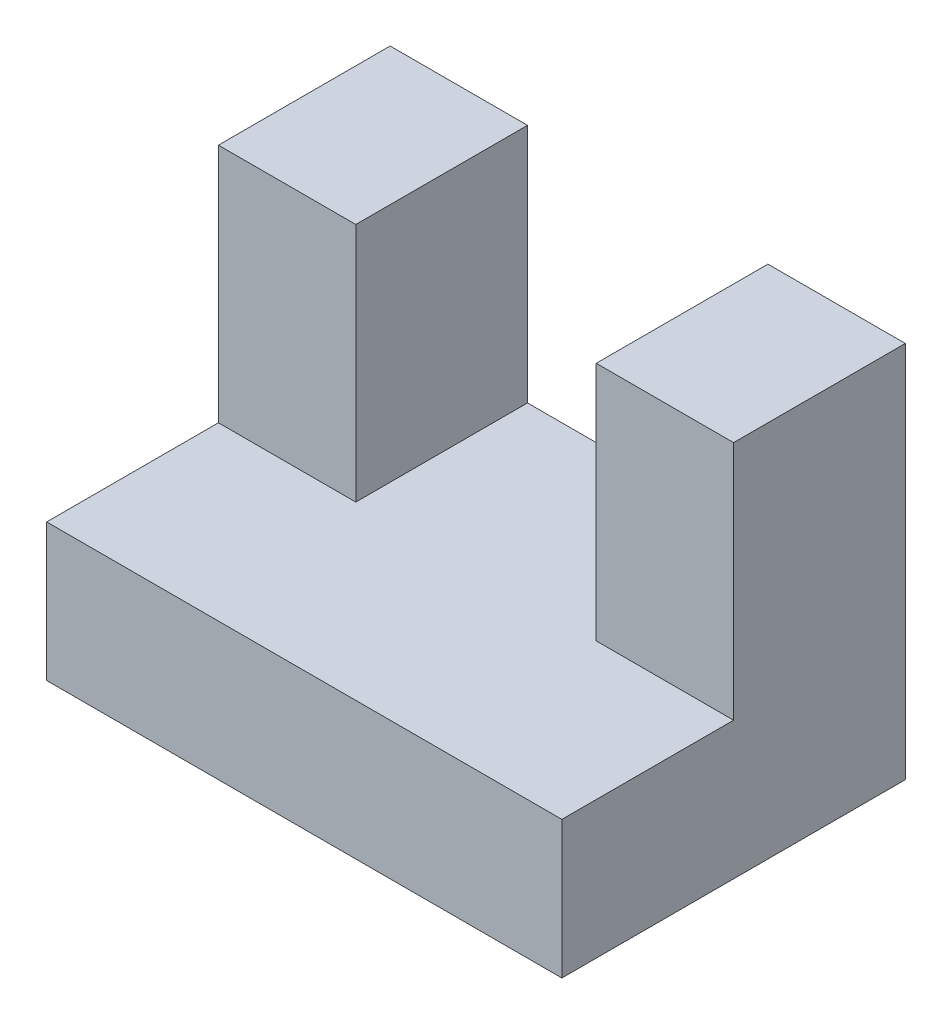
ISO-10303-21;
HEADER;
FILE_DESCRIPTION(('STEP AP214'),'2;1');
FILE_NAME('part.step','',(''),(''),'','','');
FILE_SCHEMA(('AUTOMOTIVE_DESIGN { 1 0 10303 214 1 1 1 1 }'));
ENDSEC;
DATA;
#1=APPLICATION_CONTEXT('core data for automotive mechanical design processes');
#2=APPLICATION_PROTOCOL_DEFINITION('international standard','automotive_design',2000,#1);
#3=PRODUCT_CONTEXT('',#1,'mechanical');
#4=PRODUCT('Part','Part','',(#3));
#5=PRODUCT_RELATED_PRODUCT_CATEGORY('part','',(#4));
#6=PRODUCT_DEFINITION_FORMATION('','',#4);
#7=PRODUCT_DEFINITION_CONTEXT('part definition',#1,'design');
#8=PRODUCT_DEFINITION('design','',#6,#7);
#9=PRODUCT_DEFINITION_SHAPE('','',#8);
#10=(LENGTH_UNIT() NAMED_UNIT(*) SI_UNIT(.MILLI.,.METRE.));
#11=(NAMED_UNIT(*) PLANE_ANGLE_UNIT() SI_UNIT($,.RADIAN.));
#12=(NAMED_UNIT(*) SI_UNIT($,.STERADIAN.) SOLID_ANGLE_UNIT());
#13=UNCERTAINTY_MEASURE_WITH_UNIT(LENGTH_MEASURE(1.E-05),#10,'distance_accuracy_value','');
#14=(GEOMETRIC_REPRESENTATION_CONTEXT(3) GLOBAL_UNCERTAINTY_ASSIGNED_CONTEXT((#13)) GLOBAL_UNIT_ASSIGNED_CONTEXT((#10,
#11,#12)) REPRESENTATION_CONTEXT('',''));
#15=CARTESIAN_POINT('',(0.,0.,0.));
#16=DIRECTION('',(0.,0.,1.));
#17=DIRECTION('',(1.,0.,0.));
#18=AXIS2_PLACEMENT_3D('',#15,#16,#17);
#19=CARTESIAN_POINT('',(0.,8.,-20.));
#20=DIRECTION('',(0.,-1.,0.));
#21=DIRECTION('',(0.,0.,-1.));
#22=AXIS2_PLACEMENT_3D('',#19,#20,#21);
#23=PLANE('',#22);
#24=DIRECTION('',(0.,0.,1.));
#25=VECTOR('',#24,1.);
#26=CARTESIAN_POINT('',(22.,8.,-20.));
#27=LINE('',#26,#25);
#28=CARTESIAN_POINT('',(22.,8.,-20.));
#29=VERTEX_POINT('',#28);
#30=CARTESIAN_POINT('',(22.,8.,-10.));
#31=VERTEX_POINT('',#30);
#32=EDGE_CURVE('E137',#29,#31,#27,.T.);
#33=ORIENTED_EDGE('',*,*,#32,.F.);
#34=DIRECTION('',(-1.,0.,0.));
#35=VECTOR('',#34,1.);
#36=CARTESIAN_POINT('',(0.,8.,-20.));
#37=LINE('',#36,#35);
#38=CARTESIAN_POINT('',(8.,8.,-20.));
#39=VERTEX_POINT('',#38);
#40=EDGE_CURVE('E35',#29,#39,#37,.T.);
#41=ORIENTED_EDGE('',*,*,#40,.T.);
#42=DIRECTION('',(0.,0.,-1.));
#43=VECTOR('',#42,1.);
#44=CARTESIAN_POINT('',(8.,8.,-20.));
#45=LINE('',#44,#43);
#46=CARTESIAN_POINT('',(8.,8.,-10.));
#47=VERTEX_POINT('',#46);
#48=EDGE_CURVE('E154',#47,#39,#45,.T.);
#49=ORIENTED_EDGE('',*,*,#48,.F.);
#50=DIRECTION('',(1.,0.,0.));
#51=VECTOR('',#50,1.);
#52=CARTESIAN_POINT('',(0.,8.,-10.));
#53=LINE('',#52,#51);
#54=CARTESIAN_POINT('',(0.,8.,-10.));
#55=VERTEX_POINT('',#54);
#56=EDGE_CURVE('E149',#55,#47,#53,.T.);
#57=ORIENTED_EDGE('',*,*,#56,.F.);
#58=DIRECTION('',(0.,0.,1.));
#59=VECTOR('',#58,1.);
#60=CARTESIAN_POINT('',(0.,8.,0.));
#61=LINE('',#60,#59);
#62=CARTESIAN_POINT('',(0.,8.,0.));
#63=VERTEX_POINT('',#62);
#64=EDGE_CURVE('E193',#55,#63,#61,.T.);
#65=ORIENTED_EDGE('',*,*,#64,.T.);
#66=DIRECTION('',(1.,0.,0.));
#67=VECTOR('',#66,1.);
#68=CARTESIAN_POINT('',(0.,8.,0.));
#69=LINE('',#68,#67);
#70=CARTESIAN_POINT('',(30.,8.,0.));
#71=VERTEX_POINT('',#70);
#72=EDGE_CURVE('E194',#63,#71,#69,.T.);
#73=ORIENTED_EDGE('',*,*,#72,.T.);
#74=DIRECTION('',(0.,0.,-1.));
#75=VECTOR('',#74,1.);
#76=CARTESIAN_POINT('',(30.,8.,0.));
#77=LINE('',#76,#75);
#78=CARTESIAN_POINT('',(30.,8.,-10.));
#79=VERTEX_POINT('',#78);
#80=EDGE_CURVE('E54',#71,#79,#77,.T.);
#81=ORIENTED_EDGE('',*,*,#80,.T.);
#82=DIRECTION('',(1.,0.,0.));
#83=VECTOR('',#82,1.);
#84=CARTESIAN_POINT('',(30.,8.,-10.));
#85=LINE('',#84,#83);
#86=EDGE_CURVE('E49',#31,#79,#85,.T.);
#87=ORIENTED_EDGE('',*,*,#86,.F.);
#88=EDGE_LOOP('',(#33,#41,#49,#57,#65,#73,#81,#87));
#89=FACE_BOUND('',#88,.T.);
#90=ADVANCED_FACE('F31',(#89),#23,.F.);
#91=CARTESIAN_POINT('',(0.,8.,0.));
#92=DIRECTION('',(1.,0.,0.));
#93=DIRECTION('',(0.,0.,-1.));
#94=AXIS2_PLACEMENT_3D('',#91,#92,#93);
#95=PLANE('',#94);
#96=DIRECTION('',(0.,0.,1.));
#97=VECTOR('',#96,1.);
#98=CARTESIAN_POINT('',(0.,0.,0.));
#99=LINE('',#98,#97);
#100=CARTESIAN_POINT('',(0.,0.,-20.));
#101=VERTEX_POINT('',#100);
#102=CARTESIAN_POINT('',(0.,0.,0.));
#103=VERTEX_POINT('',#102);
#104=EDGE_CURVE('E182',#101,#103,#99,.T.);
#105=ORIENTED_EDGE('',*,*,#104,.T.);
#106=DIRECTION('',(0.,-1.,0.));
#107=VECTOR('',#106,1.);
#108=CARTESIAN_POINT('',(0.,8.,0.));
#109=LINE('',#108,#107);
#110=EDGE_CURVE('E11',#63,#103,#109,.T.);
#111=ORIENTED_EDGE('',*,*,#110,.F.);
#112=ORIENTED_EDGE('',*,*,#64,.F.);
#113=DIRECTION('',(0.,-1.,0.));
#114=VECTOR('',#113,1.);
#115=CARTESIAN_POINT('',(0.,22.,-10.));
#116=LINE('',#115,#114);
#117=CARTESIAN_POINT('',(0.,22.,-10.));
#118=VERTEX_POINT('',#117);
#119=EDGE_CURVE('E177',#118,#55,#116,.T.);
#120=ORIENTED_EDGE('',*,*,#119,.F.);
#121=DIRECTION('',(0.,0.,1.));
#122=VECTOR('',#121,1.);
#123=CARTESIAN_POINT('',(0.,22.,-20.));
#124=LINE('',#123,#122);
#125=CARTESIAN_POINT('',(0.,22.,-20.));
#126=VERTEX_POINT('',#125);
#127=EDGE_CURVE('E150',#126,#118,#124,.T.);
#128=ORIENTED_EDGE('',*,*,#127,.F.);
#129=DIRECTION('',(0.,-1.,0.));
#130=VECTOR('',#129,1.);
#131=CARTESIAN_POINT('',(0.,8.,-20.));
#132=LINE('',#131,#130);
#133=EDGE_CURVE('E121',#126,#101,#132,.T.);
#134=ORIENTED_EDGE('',*,*,#133,.T.);
#135=EDGE_LOOP('',(#105,#111,#112,#120,#128,#134));
#136=FACE_BOUND('',#135,.T.);
#137=ADVANCED_FACE('F33',(#136),#95,.F.);
#138=CARTESIAN_POINT('',(0.,8.,0.));
#139=DIRECTION('',(0.,0.,-1.));
#140=DIRECTION('',(-1.,0.,0.));
#141=AXIS2_PLACEMENT_3D('',#138,#139,#140);
#142=PLANE('',#141);
#143=DIRECTION('',(1.,0.,0.));
#144=VECTOR('',#143,1.);
#145=CARTESIAN_POINT('',(0.,0.,0.));
#146=LINE('',#145,#144);
#147=CARTESIAN_POINT('',(30.,0.,0.));
#148=VERTEX_POINT('',#147);
#149=EDGE_CURVE('E187',#103,#148,#146,.T.);
#150=ORIENTED_EDGE('',*,*,#149,.T.);
#151=DIRECTION('',(0.,-1.,0.));
#152=VECTOR('',#151,1.);
#153=CARTESIAN_POINT('',(30.,8.,0.));
#154=LINE('',#153,#152);
#155=EDGE_CURVE('E41',#71,#148,#154,.T.);
#156=ORIENTED_EDGE('',*,*,#155,.F.);
#157=ORIENTED_EDGE('',*,*,#72,.F.);
#158=ORIENTED_EDGE('',*,*,#110,.T.);
#159=EDGE_LOOP('',(#150,#156,#157,#158));
#160=FACE_BOUND('',#159,.T.);
#161=ADVANCED_FACE('F233',(#160),#142,.F.);
#162=CARTESIAN_POINT('',(30.,8.,0.));
#163=DIRECTION('',(-1.,0.,0.));
#164=DIRECTION('',(0.,0.,1.));
#165=AXIS2_PLACEMENT_3D('',#162,#163,#164);
#166=PLANE('',#165);
#167=DIRECTION('',(0.,0.,-1.));
#168=VECTOR('',#167,1.);
#169=CARTESIAN_POINT('',(30.,0.,0.));
#170=LINE('',#169,#168);
#171=CARTESIAN_POINT('',(30.,0.,-20.));
#172=VERTEX_POINT('',#171);
#173=EDGE_CURVE('E118',#148,#172,#170,.T.);
#174=ORIENTED_EDGE('',*,*,#173,.T.);
#175=DIRECTION('',(0.,-1.,0.));
#176=VECTOR('',#175,1.);
#177=CARTESIAN_POINT('',(30.,8.,-20.));
#178=LINE('',#177,#176);
#179=CARTESIAN_POINT('',(30.,22.,-20.));
#180=VERTEX_POINT('',#179);
#181=EDGE_CURVE('E110',#180,#172,#178,.T.);
#182=ORIENTED_EDGE('',*,*,#181,.F.);
#183=DIRECTION('',(0.,0.,-1.));
#184=VECTOR('',#183,1.);
#185=CARTESIAN_POINT('',(30.,22.,-20.));
#186=LINE('',#185,#184);
#187=CARTESIAN_POINT('',(30.,22.,-10.));
#188=VERTEX_POINT('',#187);
#189=EDGE_CURVE('E115',#188,#180,#186,.T.);
#190=ORIENTED_EDGE('',*,*,#189,.F.);
#191=DIRECTION('',(0.,-1.,0.));
#192=VECTOR('',#191,1.);
#193=CARTESIAN_POINT('',(30.,22.,-10.));
#194=LINE('',#193,#192);
#195=EDGE_CURVE('E142',#188,#79,#194,.T.);
#196=ORIENTED_EDGE('',*,*,#195,.T.);
#197=ORIENTED_EDGE('',*,*,#80,.F.);
#198=ORIENTED_EDGE('',*,*,#155,.T.);
#199=EDGE_LOOP('',(#174,#182,#190,#196,#197,#198));
#200=FACE_BOUND('',#199,.T.);
#201=ADVANCED_FACE('F112',(#200),#166,.F.);
#202=CARTESIAN_POINT('',(0.,8.,-20.));
#203=DIRECTION('',(0.,0.,1.));
#204=DIRECTION('',(1.,0.,0.));
#205=AXIS2_PLACEMENT_3D('',#202,#203,#204);
#206=PLANE('',#205);
#207=DIRECTION('',(-1.,0.,0.));
#208=VECTOR('',#207,1.);
#209=CARTESIAN_POINT('',(0.,0.,-20.));
#210=LINE('',#209,#208);
#211=EDGE_CURVE('E195',#172,#101,#210,.T.);
#212=ORIENTED_EDGE('',*,*,#211,.T.);
#213=ORIENTED_EDGE('',*,*,#133,.F.);
#214=DIRECTION('',(-1.,0.,0.));
#215=VECTOR('',#214,1.);
#216=CARTESIAN_POINT('',(0.,22.,-20.));
#217=LINE('',#216,#215);
#218=CARTESIAN_POINT('',(8.,22.,-20.));
#219=VERTEX_POINT('',#218);
#220=EDGE_CURVE('E158',#219,#126,#217,.T.);
#221=ORIENTED_EDGE('',*,*,#220,.F.);
#222=DIRECTION('',(0.,-1.,0.));
#223=VECTOR('',#222,1.);
#224=CARTESIAN_POINT('',(8.,22.,-20.));
#225=LINE('',#224,#223);
#226=EDGE_CURVE('E161',#219,#39,#225,.T.);
#227=ORIENTED_EDGE('',*,*,#226,.T.);
#228=ORIENTED_EDGE('',*,*,#40,.F.);
#229=DIRECTION('',(0.,-1.,0.));
#230=VECTOR('',#229,1.);
#231=CARTESIAN_POINT('',(22.,22.,-20.));
#232=LINE('',#231,#230);
#233=CARTESIAN_POINT('',(22.,22.,-20.));
#234=VERTEX_POINT('',#233);
#235=EDGE_CURVE('E127',#234,#29,#232,.T.);
#236=ORIENTED_EDGE('',*,*,#235,.F.);
#237=DIRECTION('',(-1.,0.,0.));
#238=VECTOR('',#237,1.);
#239=CARTESIAN_POINT('',(30.,22.,-20.));
#240=LINE('',#239,#238);
#241=EDGE_CURVE('E124',#180,#234,#240,.T.);
#242=ORIENTED_EDGE('',*,*,#241,.F.);
#243=ORIENTED_EDGE('',*,*,#181,.T.);
#244=EDGE_LOOP('',(#212,#213,#221,#227,#228,#236,#242,#243));
#245=FACE_BOUND('',#244,.T.);
#246=ADVANCED_FACE('F125',(#245),#206,.F.);
#247=CARTESIAN_POINT('',(0.,0.,-20.));
#248=DIRECTION('',(0.,-1.,0.));
#249=DIRECTION('',(0.,0.,-1.));
#250=AXIS2_PLACEMENT_3D('',#247,#248,#249);
#251=PLANE('',#250);
#252=ORIENTED_EDGE('',*,*,#104,.F.);
#253=ORIENTED_EDGE('',*,*,#211,.F.);
#254=ORIENTED_EDGE('',*,*,#173,.F.);
#255=ORIENTED_EDGE('',*,*,#149,.F.);
#256=EDGE_LOOP('',(#252,#253,#254,#255));
#257=FACE_BOUND('',#256,.T.);
#258=ADVANCED_FACE('F211',(#257),#251,.T.);
#259=CARTESIAN_POINT('',(0.,22.,-10.));
#260=DIRECTION('',(0.,0.,-1.));
#261=DIRECTION('',(-1.,0.,0.));
#262=AXIS2_PLACEMENT_3D('',#259,#260,#261);
#263=PLANE('',#262);
#264=ORIENTED_EDGE('',*,*,#56,.T.);
#265=DIRECTION('',(0.,-1.,0.));
#266=VECTOR('',#265,1.);
#267=CARTESIAN_POINT('',(8.,22.,-10.));
#268=LINE('',#267,#266);
#269=CARTESIAN_POINT('',(8.,22.,-10.));
#270=VERTEX_POINT('',#269);
#271=EDGE_CURVE('E164',#270,#47,#268,.T.);
#272=ORIENTED_EDGE('',*,*,#271,.F.);
#273=DIRECTION('',(1.,0.,0.));
#274=VECTOR('',#273,1.);
#275=CARTESIAN_POINT('',(0.,22.,-10.));
#276=LINE('',#275,#274);
#277=EDGE_CURVE('E153',#118,#270,#276,.T.);
#278=ORIENTED_EDGE('',*,*,#277,.F.);
#279=ORIENTED_EDGE('',*,*,#119,.T.);
#280=EDGE_LOOP('',(#264,#272,#278,#279));
#281=FACE_BOUND('',#280,.T.);
#282=ADVANCED_FACE('F219',(#281),#263,.F.);
#283=CARTESIAN_POINT('',(8.,22.,-20.));
#284=DIRECTION('',(-1.,0.,0.));
#285=DIRECTION('',(0.,0.,1.));
#286=AXIS2_PLACEMENT_3D('',#283,#284,#285);
#287=PLANE('',#286);
#288=ORIENTED_EDGE('',*,*,#48,.T.);
#289=ORIENTED_EDGE('',*,*,#226,.F.);
#290=DIRECTION('',(0.,0.,-1.));
#291=VECTOR('',#290,1.);
#292=CARTESIAN_POINT('',(8.,22.,-20.));
#293=LINE('',#292,#291);
#294=EDGE_CURVE('E156',#270,#219,#293,.T.);
#295=ORIENTED_EDGE('',*,*,#294,.F.);
#296=ORIENTED_EDGE('',*,*,#271,.T.);
#297=EDGE_LOOP('',(#288,#289,#295,#296));
#298=FACE_BOUND('',#297,.T.);
#299=ADVANCED_FACE('F218',(#298),#287,.F.);
#300=CARTESIAN_POINT('',(0.,22.,-10.));
#301=DIRECTION('',(0.,1.,0.));
#302=DIRECTION('',(0.,0.,1.));
#303=AXIS2_PLACEMENT_3D('',#300,#301,#302);
#304=PLANE('',#303);
#305=ORIENTED_EDGE('',*,*,#127,.T.);
#306=ORIENTED_EDGE('',*,*,#277,.T.);
#307=ORIENTED_EDGE('',*,*,#294,.T.);
#308=ORIENTED_EDGE('',*,*,#220,.T.);
#309=EDGE_LOOP('',(#305,#306,#307,#308));
#310=FACE_BOUND('',#309,.T.);
#311=ADVANCED_FACE('F217',(#310),#304,.T.);
#312=CARTESIAN_POINT('',(22.,22.,-20.));
#313=DIRECTION('',(1.,0.,0.));
#314=DIRECTION('',(0.,0.,-1.));
#315=AXIS2_PLACEMENT_3D('',#312,#313,#314);
#316=PLANE('',#315);
#317=ORIENTED_EDGE('',*,*,#32,.T.);
#318=DIRECTION('',(0.,-1.,0.));
#319=VECTOR('',#318,1.);
#320=CARTESIAN_POINT('',(22.,22.,-10.));
#321=LINE('',#320,#319);
#322=CARTESIAN_POINT('',(22.,22.,-10.));
#323=VERTEX_POINT('',#322);
#324=EDGE_CURVE('E145',#323,#31,#321,.T.);
#325=ORIENTED_EDGE('',*,*,#324,.F.);
#326=DIRECTION('',(0.,0.,1.));
#327=VECTOR('',#326,1.);
#328=CARTESIAN_POINT('',(22.,22.,-20.));
#329=LINE('',#328,#327);
#330=EDGE_CURVE('E130',#234,#323,#329,.T.);
#331=ORIENTED_EDGE('',*,*,#330,.F.);
#332=ORIENTED_EDGE('',*,*,#235,.T.);
#333=EDGE_LOOP('',(#317,#325,#331,#332));
#334=FACE_BOUND('',#333,.T.);
#335=ADVANCED_FACE('F298',(#334),#316,.F.);
#336=CARTESIAN_POINT('',(30.,22.,-10.));
#337=DIRECTION('',(0.,0.,-1.));
#338=DIRECTION('',(-1.,0.,0.));
#339=AXIS2_PLACEMENT_3D('',#336,#337,#338);
#340=PLANE('',#339);
#341=ORIENTED_EDGE('',*,*,#86,.T.);
#342=ORIENTED_EDGE('',*,*,#195,.F.);
#343=DIRECTION('',(1.,0.,0.));
#344=VECTOR('',#343,1.);
#345=CARTESIAN_POINT('',(30.,22.,-10.));
#346=LINE('',#345,#344);
#347=EDGE_CURVE('E134',#323,#188,#346,.T.);
#348=ORIENTED_EDGE('',*,*,#347,.F.);
#349=ORIENTED_EDGE('',*,*,#324,.T.);
#350=EDGE_LOOP('',(#341,#342,#348,#349));
#351=FACE_BOUND('',#350,.T.);
#352=ADVANCED_FACE('F306',(#351),#340,.F.);
#353=CARTESIAN_POINT('',(30.,22.,-20.));
#354=DIRECTION('',(0.,-1.,0.));
#355=DIRECTION('',(0.,0.,-1.));
#356=AXIS2_PLACEMENT_3D('',#353,#354,#355);
#357=PLANE('',#356);
#358=ORIENTED_EDGE('',*,*,#189,.T.);
#359=ORIENTED_EDGE('',*,*,#241,.T.);
#360=ORIENTED_EDGE('',*,*,#330,.T.);
#361=ORIENTED_EDGE('',*,*,#347,.T.);
#362=EDGE_LOOP('',(#358,#359,#360,#361));
#363=FACE_BOUND('',#362,.T.);
#364=ADVANCED_FACE('F132',(#363),#357,.F.);
#365=CLOSED_SHELL('',(#90,#137,#161,#201,#246,#258,#282,#299,#311,#335,#352,#364));
#366=MANIFOLD_SOLID_BREP('B2',#365);
#367=ADVANCED_BREP_SHAPE_REPRESENTATION('',(#18,#366),#14);
#368=SHAPE_DEFINITION_REPRESENTATION(#9,#367);
ENDSEC;
END-ISO-10303-21;
